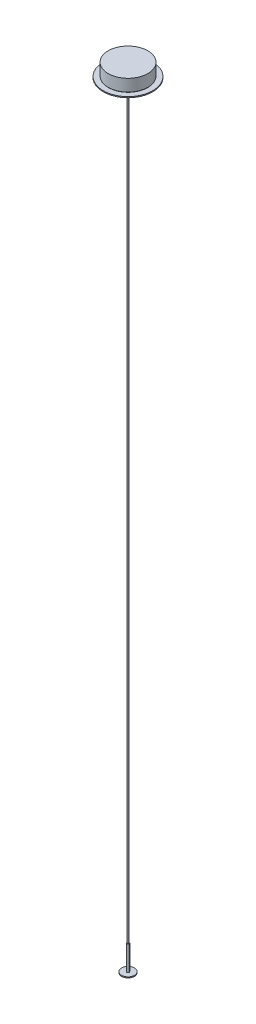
ISO-10303-21;
HEADER;
FILE_DESCRIPTION(('STEP AP214'),'2;1');
FILE_NAME('part.step','',(''),(''),'','','');
FILE_SCHEMA(('AUTOMOTIVE_DESIGN { 1 0 10303 214 1 1 1 1 }'));
ENDSEC;
DATA;
#1=APPLICATION_CONTEXT('core data for automotive mechanical design processes');
#2=APPLICATION_PROTOCOL_DEFINITION('international standard','automotive_design',2000,#1);
#3=PRODUCT_CONTEXT('',#1,'mechanical');
#4=PRODUCT('Part','Part','',(#3));
#5=PRODUCT_RELATED_PRODUCT_CATEGORY('part','',(#4));
#6=PRODUCT_DEFINITION_FORMATION('','',#4);
#7=PRODUCT_DEFINITION_CONTEXT('part definition',#1,'design');
#8=PRODUCT_DEFINITION('design','',#6,#7);
#9=PRODUCT_DEFINITION_SHAPE('','',#8);
#10=(LENGTH_UNIT() NAMED_UNIT(*) SI_UNIT(.MILLI.,.METRE.));
#11=(NAMED_UNIT(*) PLANE_ANGLE_UNIT() SI_UNIT($,.RADIAN.));
#12=(NAMED_UNIT(*) SI_UNIT($,.STERADIAN.) SOLID_ANGLE_UNIT());
#13=UNCERTAINTY_MEASURE_WITH_UNIT(LENGTH_MEASURE(1.E-05),#10,'distance_accuracy_value','');
#14=(GEOMETRIC_REPRESENTATION_CONTEXT(3) GLOBAL_UNCERTAINTY_ASSIGNED_CONTEXT((#13)) GLOBAL_UNIT_ASSIGNED_CONTEXT((#10,
#11,#12)) REPRESENTATION_CONTEXT('',''));
#15=CARTESIAN_POINT('',(0.,0.,0.));
#16=DIRECTION('',(0.,0.,1.));
#17=DIRECTION('',(1.,0.,0.));
#18=AXIS2_PLACEMENT_3D('',#15,#16,#17);
#19=CARTESIAN_POINT('',(0.,-1567.,0.));
#20=DIRECTION('',(0.,1.,0.));
#21=DIRECTION('',(0.,0.,1.));
#22=AXIS2_PLACEMENT_3D('',#19,#20,#21);
#23=CYLINDRICAL_SURFACE('',#22,2.5);
#24=CARTESIAN_POINT('',(0.,-1567.,0.));
#25=DIRECTION('',(0.,-1.,0.));
#26=DIRECTION('',(0.,0.,-1.));
#27=AXIS2_PLACEMENT_3D('',#24,#25,#26);
#28=CIRCLE('',#27,2.5);
#29=CARTESIAN_POINT('',(0.,-1567.,-2.5));
#30=VERTEX_POINT('',#29);
#31=EDGE_CURVE('E11',#30,#30,#28,.T.);
#32=ORIENTED_EDGE('',*,*,#31,.F.);
#33=EDGE_LOOP('',(#32));
#34=FACE_BOUND('',#33,.T.);
#35=CARTESIAN_POINT('',(0.,-1517.,0.));
#36=DIRECTION('',(0.,-1.,0.));
#37=DIRECTION('',(0.,0.,-1.));
#38=AXIS2_PLACEMENT_3D('',#35,#36,#37);
#39=CIRCLE('',#38,2.5);
#40=CARTESIAN_POINT('',(0.,-1517.,-2.5));
#41=VERTEX_POINT('',#40);
#42=EDGE_CURVE('E45',#41,#41,#39,.T.);
#43=ORIENTED_EDGE('',*,*,#42,.T.);
#44=EDGE_LOOP('',(#43));
#45=FACE_BOUND('',#44,.T.);
#46=ADVANCED_FACE('F42',(#34,#45),#23,.T.);
#47=CARTESIAN_POINT('',(0.,-1517.,0.));
#48=DIRECTION('',(0.,-1.,0.));
#49=DIRECTION('',(0.,0.,-1.));
#50=AXIS2_PLACEMENT_3D('',#47,#48,#49);
#51=PLANE('',#50);
#52=ORIENTED_EDGE('',*,*,#42,.F.);
#53=EDGE_LOOP('',(#52));
#54=FACE_BOUND('',#53,.T.);
#55=ADVANCED_FACE('F65',(#54),#51,.F.);
#56=CARTESIAN_POINT('',(0.,-1569.,0.));
#57=DIRECTION('',(0.,1.,0.));
#58=DIRECTION('',(0.,0.,1.));
#59=AXIS2_PLACEMENT_3D('',#56,#57,#58);
#60=CYLINDRICAL_SURFACE('',#59,13.);
#61=CARTESIAN_POINT('',(0.,-1569.,0.));
#62=DIRECTION('',(0.,-1.,0.));
#63=DIRECTION('',(0.,0.,-1.));
#64=AXIS2_PLACEMENT_3D('',#61,#62,#63);
#65=CIRCLE('',#64,13.);
#66=CARTESIAN_POINT('',(0.,-1569.,-13.));
#67=VERTEX_POINT('',#66);
#68=EDGE_CURVE('E52',#67,#67,#65,.T.);
#69=ORIENTED_EDGE('',*,*,#68,.F.);
#70=EDGE_LOOP('',(#69));
#71=FACE_BOUND('',#70,.T.);
#72=CARTESIAN_POINT('',(0.,-1567.,0.));
#73=DIRECTION('',(0.,-1.,0.));
#74=DIRECTION('',(0.,0.,-1.));
#75=AXIS2_PLACEMENT_3D('',#72,#73,#74);
#76=CIRCLE('',#75,13.);
#77=CARTESIAN_POINT('',(0.,-1567.,-13.));
#78=VERTEX_POINT('',#77);
#79=EDGE_CURVE('E54',#78,#78,#76,.T.);
#80=ORIENTED_EDGE('',*,*,#79,.T.);
#81=EDGE_LOOP('',(#80));
#82=FACE_BOUND('',#81,.T.);
#83=ADVANCED_FACE('F62',(#71,#82),#60,.T.);
#84=CARTESIAN_POINT('',(0.,-1569.,0.));
#85=DIRECTION('',(0.,-1.,0.));
#86=DIRECTION('',(0.,0.,-1.));
#87=AXIS2_PLACEMENT_3D('',#84,#85,#86);
#88=PLANE('',#87);
#89=ORIENTED_EDGE('',*,*,#68,.T.);
#90=EDGE_LOOP('',(#89));
#91=FACE_BOUND('',#90,.T.);
#92=ADVANCED_FACE('F60',(#91),#88,.T.);
#93=CARTESIAN_POINT('',(0.,-1567.,0.));
#94=DIRECTION('',(0.,-1.,0.));
#95=DIRECTION('',(0.,0.,-1.));
#96=AXIS2_PLACEMENT_3D('',#93,#94,#95);
#97=PLANE('',#96);
#98=ORIENTED_EDGE('',*,*,#31,.T.);
#99=EDGE_LOOP('',(#98));
#100=FACE_BOUND('',#99,.T.);
#101=ORIENTED_EDGE('',*,*,#79,.F.);
#102=EDGE_LOOP('',(#101));
#103=FACE_BOUND('',#102,.T.);
#104=ADVANCED_FACE('F69',(#100,#103),#97,.F.);
#105=CLOSED_SHELL('',(#46,#55,#83,#92,#104));
#106=MANIFOLD_SOLID_BREP('B2',#105);
#107=CARTESIAN_POINT('',(0.,-1517.,0.));
#108=DIRECTION('',(0.,1.,0.));
#109=DIRECTION('',(0.,0.,1.));
#110=AXIS2_PLACEMENT_3D('',#107,#108,#109);
#111=CYLINDRICAL_SURFACE('',#110,1.5);
#112=CARTESIAN_POINT('',(0.,-1517.,0.));
#113=DIRECTION('',(0.,-1.,0.));
#114=DIRECTION('',(0.,0.,-1.));
#115=AXIS2_PLACEMENT_3D('',#112,#113,#114);
#116=CIRCLE('',#115,1.5);
#117=CARTESIAN_POINT('',(0.,-1517.,-1.5));
#118=VERTEX_POINT('',#117);
#119=EDGE_CURVE('E41',#118,#118,#116,.T.);
#120=ORIENTED_EDGE('',*,*,#119,.F.);
#121=EDGE_LOOP('',(#120));
#122=FACE_BOUND('',#121,.T.);
#123=CARTESIAN_POINT('',(0.,-17.,0.));
#124=DIRECTION('',(0.,-1.,0.));
#125=DIRECTION('',(0.,0.,-1.));
#126=AXIS2_PLACEMENT_3D('',#123,#124,#125);
#127=CIRCLE('',#126,1.5);
#128=CARTESIAN_POINT('',(0.,-17.,-1.5));
#129=VERTEX_POINT('',#128);
#130=EDGE_CURVE('E124',#129,#129,#127,.T.);
#131=ORIENTED_EDGE('',*,*,#130,.T.);
#132=EDGE_LOOP('',(#131));
#133=FACE_BOUND('',#132,.T.);
#134=ADVANCED_FACE('F121',(#122,#133),#111,.T.);
#135=CARTESIAN_POINT('',(0.,-1517.,0.));
#136=DIRECTION('',(0.,-1.,0.));
#137=DIRECTION('',(0.,0.,-1.));
#138=AXIS2_PLACEMENT_3D('',#135,#136,#137);
#139=PLANE('',#138);
#140=ORIENTED_EDGE('',*,*,#119,.T.);
#141=EDGE_LOOP('',(#140));
#142=FACE_BOUND('',#141,.T.);
#143=ADVANCED_FACE('F136',(#142),#139,.T.);
#144=CARTESIAN_POINT('',(0.,-17.,0.));
#145=DIRECTION('',(0.,-1.,0.));
#146=DIRECTION('',(0.,0.,-1.));
#147=AXIS2_PLACEMENT_3D('',#144,#145,#146);
#148=PLANE('',#147);
#149=ORIENTED_EDGE('',*,*,#130,.F.);
#150=EDGE_LOOP('',(#149));
#151=FACE_BOUND('',#150,.T.);
#152=ADVANCED_FACE('F134',(#151),#148,.F.);
#153=CLOSED_SHELL('',(#134,#143,#152));
#154=MANIFOLD_SOLID_BREP('B6',#153);
#155=CARTESIAN_POINT('',(0.,-17.,0.));
#156=DIRECTION('',(0.,1.,0.));
#157=DIRECTION('',(0.,0.,1.));
#158=AXIS2_PLACEMENT_3D('',#155,#156,#157);
#159=CYLINDRICAL_SURFACE('',#158,6.);
#160=CARTESIAN_POINT('',(0.,-17.,0.));
#161=DIRECTION('',(0.,-1.,0.));
#162=DIRECTION('',(0.,0.,-1.));
#163=AXIS2_PLACEMENT_3D('',#160,#161,#162);
#164=CIRCLE('',#163,6.);
#165=CARTESIAN_POINT('',(0.,-17.,-6.));
#166=VERTEX_POINT('',#165);
#167=EDGE_CURVE('E120',#166,#166,#164,.T.);
#168=ORIENTED_EDGE('',*,*,#167,.F.);
#169=EDGE_LOOP('',(#168));
#170=FACE_BOUND('',#169,.T.);
#171=CARTESIAN_POINT('',(0.,-2.,0.));
#172=DIRECTION('',(0.,-1.,0.));
#173=DIRECTION('',(0.,0.,-1.));
#174=AXIS2_PLACEMENT_3D('',#171,#172,#173);
#175=CIRCLE('',#174,6.);
#176=CARTESIAN_POINT('',(0.,-2.,-6.));
#177=VERTEX_POINT('',#176);
#178=EDGE_CURVE('E172',#177,#177,#175,.T.);
#179=ORIENTED_EDGE('',*,*,#178,.T.);
#180=EDGE_LOOP('',(#179));
#181=FACE_BOUND('',#180,.T.);
#182=ADVANCED_FACE('F169',(#170,#181),#159,.T.);
#183=CARTESIAN_POINT('',(0.,-17.,0.));
#184=DIRECTION('',(0.,-1.,0.));
#185=DIRECTION('',(0.,0.,-1.));
#186=AXIS2_PLACEMENT_3D('',#183,#184,#185);
#187=PLANE('',#186);
#188=ORIENTED_EDGE('',*,*,#167,.T.);
#189=EDGE_LOOP('',(#188));
#190=FACE_BOUND('',#189,.T.);
#191=ADVANCED_FACE('F184',(#190),#187,.T.);
#192=CARTESIAN_POINT('',(0.,-2.,0.));
#193=DIRECTION('',(0.,-1.,0.));
#194=DIRECTION('',(0.,0.,-1.));
#195=AXIS2_PLACEMENT_3D('',#192,#193,#194);
#196=PLANE('',#195);
#197=ORIENTED_EDGE('',*,*,#178,.F.);
#198=EDGE_LOOP('',(#197));
#199=FACE_BOUND('',#198,.T.);
#200=ADVANCED_FACE('F182',(#199),#196,.F.);
#201=CLOSED_SHELL('',(#182,#191,#200));
#202=MANIFOLD_SOLID_BREP('B36',#201);
#203=CARTESIAN_POINT('',(0.,25.,0.));
#204=DIRECTION('',(0.,-1.,0.));
#205=DIRECTION('',(0.,0.,-1.));
#206=AXIS2_PLACEMENT_3D('',#203,#204,#205);
#207=CYLINDRICAL_SURFACE('',#206,40.);
#208=CARTESIAN_POINT('',(0.,1.,0.));
#209=DIRECTION('',(0.,1.,0.));
#210=DIRECTION('',(0.,0.,1.));
#211=AXIS2_PLACEMENT_3D('',#208,#209,#210);
#212=CIRCLE('',#211,40.);
#213=CARTESIAN_POINT('',(0.,1.,40.));
#214=VERTEX_POINT('',#213);
#215=EDGE_CURVE('E217',#214,#214,#212,.T.);
#216=ORIENTED_EDGE('',*,*,#215,.T.);
#217=EDGE_LOOP('',(#216));
#218=FACE_BOUND('',#217,.T.);
#219=CARTESIAN_POINT('',(0.,25.,0.));
#220=DIRECTION('',(0.,1.,0.));
#221=DIRECTION('',(0.,0.,1.));
#222=AXIS2_PLACEMENT_3D('',#219,#220,#221);
#223=CIRCLE('',#222,40.);
#224=CARTESIAN_POINT('',(0.,25.,40.));
#225=VERTEX_POINT('',#224);
#226=EDGE_CURVE('E221',#225,#225,#223,.T.);
#227=ORIENTED_EDGE('',*,*,#226,.F.);
#228=EDGE_LOOP('',(#227));
#229=FACE_BOUND('',#228,.T.);
#230=ADVANCED_FACE('F210',(#218,#229),#207,.T.);
#231=CARTESIAN_POINT('',(0.,25.,0.));
#232=DIRECTION('',(0.,1.,0.));
#233=DIRECTION('',(0.,0.,1.));
#234=AXIS2_PLACEMENT_3D('',#231,#232,#233);
#235=PLANE('',#234);
#236=ORIENTED_EDGE('',*,*,#226,.T.);
#237=EDGE_LOOP('',(#236));
#238=FACE_BOUND('',#237,.T.);
#239=ADVANCED_FACE('F250',(#238),#235,.T.);
#240=CARTESIAN_POINT('',(0.,1.,0.));
#241=DIRECTION('',(0.,1.,0.));
#242=DIRECTION('',(0.,0.,1.));
#243=AXIS2_PLACEMENT_3D('',#240,#241,#242);
#244=TOROIDAL_SURFACE('',#243,39.,1.);
#245=CARTESIAN_POINT('',(0.,0.,0.));
#246=DIRECTION('',(0.,1.,0.));
#247=DIRECTION('',(0.,0.,1.));
#248=AXIS2_PLACEMENT_3D('',#245,#246,#247);
#249=CIRCLE('',#248,39.);
#250=CARTESIAN_POINT('',(0.,0.,39.));
#251=VERTEX_POINT('',#250);
#252=EDGE_CURVE('E168',#251,#251,#249,.F.);
#253=ORIENTED_EDGE('',*,*,#252,.F.);
#254=EDGE_LOOP('',(#253));
#255=FACE_BOUND('',#254,.T.);
#256=ORIENTED_EDGE('',*,*,#215,.F.);
#257=EDGE_LOOP('',(#256));
#258=FACE_BOUND('',#257,.T.);
#259=ADVANCED_FACE('F212',(#255,#258),#244,.T.);
#260=CARTESIAN_POINT('',(0.,-2.,0.));
#261=DIRECTION('',(0.,1.,0.));
#262=DIRECTION('',(0.,0.,1.));
#263=AXIS2_PLACEMENT_3D('',#260,#261,#262);
#264=CYLINDRICAL_SURFACE('',#263,50.);
#265=CARTESIAN_POINT('',(0.,-2.,0.));
#266=DIRECTION('',(0.,-1.,0.));
#267=DIRECTION('',(0.,0.,-1.));
#268=AXIS2_PLACEMENT_3D('',#265,#266,#267);
#269=CIRCLE('',#268,50.);
#270=CARTESIAN_POINT('',(0.,-2.,-50.));
#271=VERTEX_POINT('',#270);
#272=EDGE_CURVE('E225',#271,#271,#269,.T.);
#273=ORIENTED_EDGE('',*,*,#272,.F.);
#274=EDGE_LOOP('',(#273));
#275=FACE_BOUND('',#274,.T.);
#276=CARTESIAN_POINT('',(0.,0.,0.));
#277=DIRECTION('',(0.,-1.,0.));
#278=DIRECTION('',(0.,0.,-1.));
#279=AXIS2_PLACEMENT_3D('',#276,#277,#278);
#280=CIRCLE('',#279,50.);
#281=CARTESIAN_POINT('',(0.,0.,-50.));
#282=VERTEX_POINT('',#281);
#283=EDGE_CURVE('E228',#282,#282,#280,.T.);
#284=ORIENTED_EDGE('',*,*,#283,.T.);
#285=EDGE_LOOP('',(#284));
#286=FACE_BOUND('',#285,.T.);
#287=ADVANCED_FACE('F236',(#275,#286),#264,.T.);
#288=CARTESIAN_POINT('',(0.,-2.,0.));
#289=DIRECTION('',(0.,-1.,0.));
#290=DIRECTION('',(0.,0.,-1.));
#291=AXIS2_PLACEMENT_3D('',#288,#289,#290);
#292=PLANE('',#291);
#293=ORIENTED_EDGE('',*,*,#272,.T.);
#294=EDGE_LOOP('',(#293));
#295=FACE_BOUND('',#294,.T.);
#296=ADVANCED_FACE('F234',(#295),#292,.T.);
#297=CARTESIAN_POINT('',(0.,0.,0.));
#298=DIRECTION('',(0.,-1.,0.));
#299=DIRECTION('',(0.,0.,-1.));
#300=AXIS2_PLACEMENT_3D('',#297,#298,#299);
#301=PLANE('',#300);
#302=ORIENTED_EDGE('',*,*,#252,.T.);
#303=EDGE_LOOP('',(#302));
#304=FACE_BOUND('',#303,.T.);
#305=ORIENTED_EDGE('',*,*,#283,.F.);
#306=EDGE_LOOP('',(#305));
#307=FACE_BOUND('',#306,.T.);
#308=ADVANCED_FACE('F242',(#304,#307),#301,.F.);
#309=CLOSED_SHELL('',(#230,#239,#259,#287,#296,#308));
#310=MANIFOLD_SOLID_BREP('B115',#309);
#311=ADVANCED_BREP_SHAPE_REPRESENTATION('',(#18,#106,#154,#202,#310),#14);
#312=SHAPE_DEFINITION_REPRESENTATION(#9,#311);
ENDSEC;
END-ISO-10303-21;
